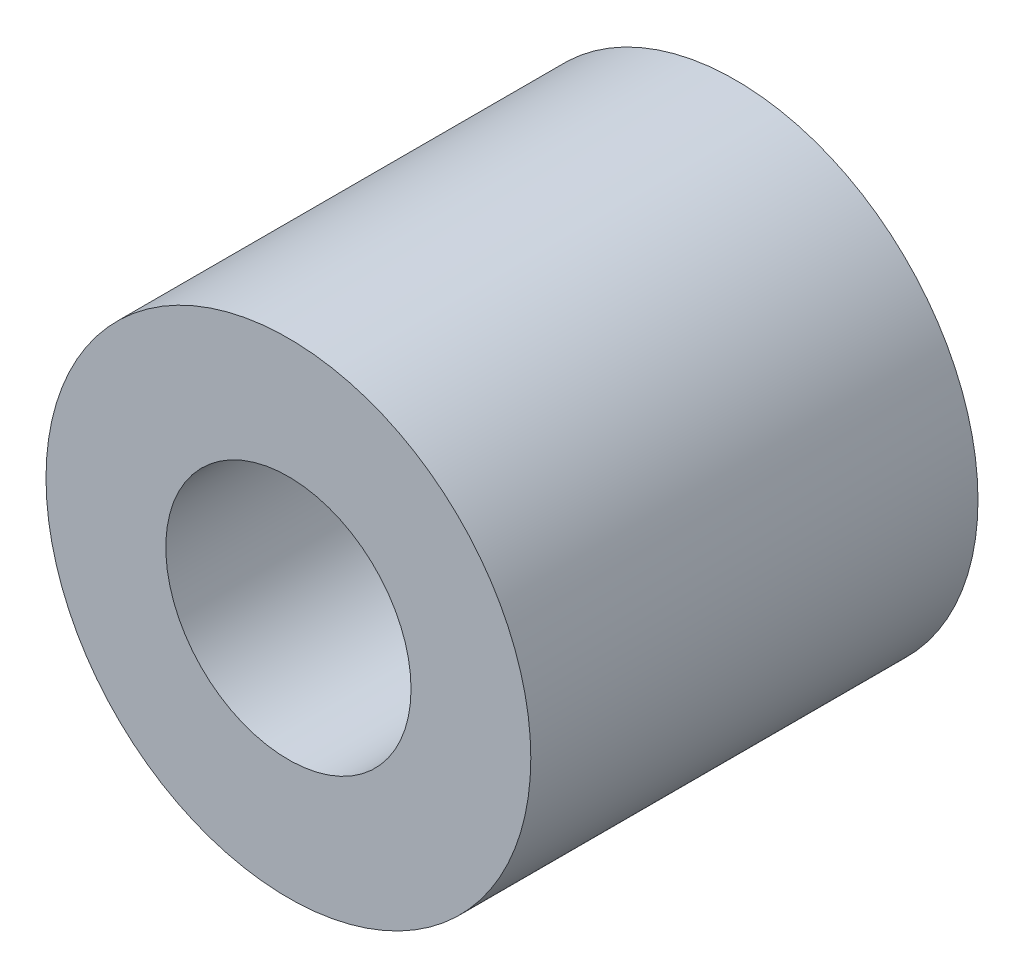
ISO-10303-21;
HEADER;
FILE_DESCRIPTION(('STEP AP214'),'2;1');
FILE_NAME('part.step','',(''),(''),'','','');
FILE_SCHEMA(('AUTOMOTIVE_DESIGN { 1 0 10303 214 1 1 1 1 }'));
ENDSEC;
DATA;
#1=APPLICATION_CONTEXT('core data for automotive mechanical design processes');
#2=APPLICATION_PROTOCOL_DEFINITION('international standard','automotive_design',2000,#1);
#3=PRODUCT_CONTEXT('',#1,'mechanical');
#4=PRODUCT('Part','Part','',(#3));
#5=PRODUCT_RELATED_PRODUCT_CATEGORY('part','',(#4));
#6=PRODUCT_DEFINITION_FORMATION('','',#4);
#7=PRODUCT_DEFINITION_CONTEXT('part definition',#1,'design');
#8=PRODUCT_DEFINITION('design','',#6,#7);
#9=PRODUCT_DEFINITION_SHAPE('','',#8);
#10=(LENGTH_UNIT() NAMED_UNIT(*) SI_UNIT(.MILLI.,.METRE.));
#11=(NAMED_UNIT(*) PLANE_ANGLE_UNIT() SI_UNIT($,.RADIAN.));
#12=(NAMED_UNIT(*) SI_UNIT($,.STERADIAN.) SOLID_ANGLE_UNIT());
#13=UNCERTAINTY_MEASURE_WITH_UNIT(LENGTH_MEASURE(1.E-05),#10,'distance_accuracy_value','');
#14=(GEOMETRIC_REPRESENTATION_CONTEXT(3) GLOBAL_UNCERTAINTY_ASSIGNED_CONTEXT((#13)) GLOBAL_UNIT_ASSIGNED_CONTEXT((#10,
#11,#12)) REPRESENTATION_CONTEXT('',''));
#15=CARTESIAN_POINT('',(0.,0.,0.));
#16=DIRECTION('',(0.,0.,1.));
#17=DIRECTION('',(1.,0.,0.));
#18=AXIS2_PLACEMENT_3D('',#15,#16,#17);
#19=CARTESIAN_POINT('',(0.,0.,59.));
#20=DIRECTION('',(0.,0.,1.));
#21=DIRECTION('',(1.,0.,0.));
#22=AXIS2_PLACEMENT_3D('',#19,#20,#21);
#23=PLANE('',#22);
#24=CARTESIAN_POINT('',(0.,0.,59.));
#25=DIRECTION('',(0.,0.,1.));
#26=DIRECTION('',(1.,0.,0.));
#27=AXIS2_PLACEMENT_3D('',#24,#25,#26);
#28=CIRCLE('',#27,31.9828734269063);
#29=CARTESIAN_POINT('',(31.9828734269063,0.,59.));
#30=VERTEX_POINT('',#29);
#31=EDGE_CURVE('E10',#30,#30,#28,.T.);
#32=ORIENTED_EDGE('',*,*,#31,.T.);
#33=EDGE_LOOP('',(#32));
#34=FACE_BOUND('',#33,.T.);
#35=CARTESIAN_POINT('',(0.,0.,59.));
#36=DIRECTION('',(0.,0.,1.));
#37=DIRECTION('',(1.,0.,0.));
#38=AXIS2_PLACEMENT_3D('',#35,#36,#37);
#39=CIRCLE('',#38,16.1786745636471);
#40=CARTESIAN_POINT('',(16.1786745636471,0.,59.));
#41=VERTEX_POINT('',#40);
#42=EDGE_CURVE('E43',#41,#41,#39,.T.);
#43=ORIENTED_EDGE('',*,*,#42,.F.);
#44=EDGE_LOOP('',(#43));
#45=FACE_BOUND('',#44,.T.);
#46=ADVANCED_FACE('F32',(#34,#45),#23,.T.);
#47=CARTESIAN_POINT('',(0.,0.,0.));
#48=DIRECTION('',(0.,0.,1.));
#49=DIRECTION('',(1.,0.,0.));
#50=AXIS2_PLACEMENT_3D('',#47,#48,#49);
#51=PLANE('',#50);
#52=CARTESIAN_POINT('',(0.,0.,0.));
#53=DIRECTION('',(0.,0.,1.));
#54=DIRECTION('',(1.,0.,0.));
#55=AXIS2_PLACEMENT_3D('',#52,#53,#54);
#56=CIRCLE('',#55,31.9828734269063);
#57=CARTESIAN_POINT('',(31.9828734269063,0.,0.));
#58=VERTEX_POINT('',#57);
#59=EDGE_CURVE('E36',#58,#58,#56,.T.);
#60=ORIENTED_EDGE('',*,*,#59,.F.);
#61=EDGE_LOOP('',(#60));
#62=FACE_BOUND('',#61,.T.);
#63=CARTESIAN_POINT('',(0.,0.,0.));
#64=DIRECTION('',(0.,0.,1.));
#65=DIRECTION('',(1.,0.,0.));
#66=AXIS2_PLACEMENT_3D('',#63,#64,#65);
#67=CIRCLE('',#66,16.1786745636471);
#68=CARTESIAN_POINT('',(16.1786745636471,0.,0.));
#69=VERTEX_POINT('',#68);
#70=EDGE_CURVE('E45',#69,#69,#67,.T.);
#71=ORIENTED_EDGE('',*,*,#70,.T.);
#72=EDGE_LOOP('',(#71));
#73=FACE_BOUND('',#72,.T.);
#74=ADVANCED_FACE('F55',(#62,#73),#51,.F.);
#75=CARTESIAN_POINT('',(0.,0.,59.));
#76=DIRECTION('',(0.,0.,-1.));
#77=DIRECTION('',(-1.,0.,0.));
#78=AXIS2_PLACEMENT_3D('',#75,#76,#77);
#79=CYLINDRICAL_SURFACE('',#78,31.9828734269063);
#80=ORIENTED_EDGE('',*,*,#31,.F.);
#81=EDGE_LOOP('',(#80));
#82=FACE_BOUND('',#81,.T.);
#83=ORIENTED_EDGE('',*,*,#59,.T.);
#84=EDGE_LOOP('',(#83));
#85=FACE_BOUND('',#84,.T.);
#86=ADVANCED_FACE('F34',(#82,#85),#79,.T.);
#87=CARTESIAN_POINT('',(0.,0.,59.));
#88=DIRECTION('',(0.,0.,-1.));
#89=DIRECTION('',(-1.,0.,0.));
#90=AXIS2_PLACEMENT_3D('',#87,#88,#89);
#91=CYLINDRICAL_SURFACE('',#90,16.1786745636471);
#92=ORIENTED_EDGE('',*,*,#42,.T.);
#93=EDGE_LOOP('',(#92));
#94=FACE_BOUND('',#93,.T.);
#95=ORIENTED_EDGE('',*,*,#70,.F.);
#96=EDGE_LOOP('',(#95));
#97=FACE_BOUND('',#96,.T.);
#98=ADVANCED_FACE('F51',(#94,#97),#91,.F.);
#99=CLOSED_SHELL('',(#46,#74,#86,#98));
#100=MANIFOLD_SOLID_BREP('B2',#99);
#101=ADVANCED_BREP_SHAPE_REPRESENTATION('',(#18,#100),#14);
#102=SHAPE_DEFINITION_REPRESENTATION(#9,#101);
ENDSEC;
END-ISO-10303-21;
